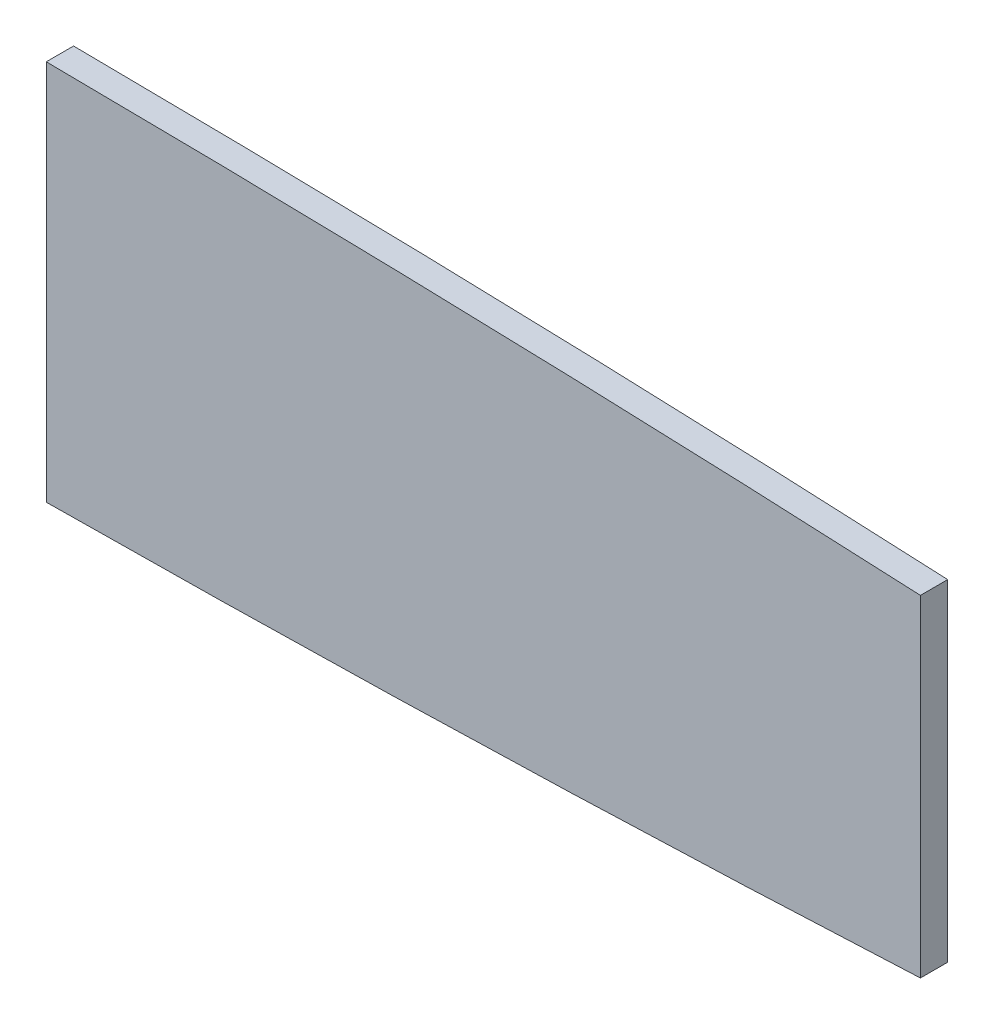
ISO-10303-21;
HEADER;
FILE_DESCRIPTION(('STEP AP214'),'2;1');
FILE_NAME('part.step','',(''),(''),'','','');
FILE_SCHEMA(('AUTOMOTIVE_DESIGN { 1 0 10303 214 1 1 1 1 }'));
ENDSEC;
DATA;
#1=APPLICATION_CONTEXT('core data for automotive mechanical design processes');
#2=APPLICATION_PROTOCOL_DEFINITION('international standard','automotive_design',2000,#1);
#3=PRODUCT_CONTEXT('',#1,'mechanical');
#4=PRODUCT('Part','Part','',(#3));
#5=PRODUCT_RELATED_PRODUCT_CATEGORY('part','',(#4));
#6=PRODUCT_DEFINITION_FORMATION('','',#4);
#7=PRODUCT_DEFINITION_CONTEXT('part definition',#1,'design');
#8=PRODUCT_DEFINITION('design','',#6,#7);
#9=PRODUCT_DEFINITION_SHAPE('','',#8);
#10=(LENGTH_UNIT() NAMED_UNIT(*) SI_UNIT(.MILLI.,.METRE.));
#11=(NAMED_UNIT(*) PLANE_ANGLE_UNIT() SI_UNIT($,.RADIAN.));
#12=(NAMED_UNIT(*) SI_UNIT($,.STERADIAN.) SOLID_ANGLE_UNIT());
#13=UNCERTAINTY_MEASURE_WITH_UNIT(LENGTH_MEASURE(1.E-05),#10,'distance_accuracy_value','');
#14=(GEOMETRIC_REPRESENTATION_CONTEXT(3) GLOBAL_UNCERTAINTY_ASSIGNED_CONTEXT((#13)) GLOBAL_UNIT_ASSIGNED_CONTEXT((#10,
#11,#12)) REPRESENTATION_CONTEXT('',''));
#15=CARTESIAN_POINT('',(0.,0.,0.));
#16=DIRECTION('',(0.,0.,1.));
#17=DIRECTION('',(1.,0.,0.));
#18=AXIS2_PLACEMENT_3D('',#15,#16,#17);
#19=CARTESIAN_POINT('',(-159.996470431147,69.8209004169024,10.));
#20=DIRECTION('',(1.,0.,0.));
#21=DIRECTION('',(0.,1.,0.));
#22=AXIS2_PLACEMENT_3D('',#19,#20,#21);
#23=PLANE('',#22);
#24=DIRECTION('',(0.,-1.,0.));
#25=VECTOR('',#24,1.);
#26=CARTESIAN_POINT('',(-159.996470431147,69.8209004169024,0.));
#27=LINE('',#26,#25);
#28=CARTESIAN_POINT('',(-159.996470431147,69.8209004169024,0.));
#29=VERTEX_POINT('',#28);
#30=CARTESIAN_POINT('',(-159.996470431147,-69.8209004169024,0.));
#31=VERTEX_POINT('',#30);
#32=EDGE_CURVE('E85',#29,#31,#27,.T.);
#33=ORIENTED_EDGE('',*,*,#32,.T.);
#34=DIRECTION('',(0.,0.,-1.));
#35=VECTOR('',#34,1.);
#36=CARTESIAN_POINT('',(-159.996470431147,-69.8209004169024,10.));
#37=LINE('',#36,#35);
#38=CARTESIAN_POINT('',(-159.996470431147,-69.8209004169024,10.));
#39=VERTEX_POINT('',#38);
#40=EDGE_CURVE('E39',#39,#31,#37,.T.);
#41=ORIENTED_EDGE('',*,*,#40,.F.);
#42=DIRECTION('',(0.,-1.,0.));
#43=VECTOR('',#42,1.);
#44=CARTESIAN_POINT('',(-159.996470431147,69.8209004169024,10.));
#45=LINE('',#44,#43);
#46=CARTESIAN_POINT('',(-159.996470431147,69.8209004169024,10.));
#47=VERTEX_POINT('',#46);
#48=EDGE_CURVE('E77',#47,#39,#45,.T.);
#49=ORIENTED_EDGE('',*,*,#48,.F.);
#50=DIRECTION('',(0.,0.,-1.));
#51=VECTOR('',#50,1.);
#52=CARTESIAN_POINT('',(-159.996470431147,69.8209004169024,10.));
#53=LINE('',#52,#51);
#54=EDGE_CURVE('E11',#47,#29,#53,.T.);
#55=ORIENTED_EDGE('',*,*,#54,.T.);
#56=EDGE_LOOP('',(#33,#41,#49,#55));
#57=FACE_BOUND('',#56,.T.);
#58=ADVANCED_FACE('F31',(#57),#23,.F.);
#59=CARTESIAN_POINT('',(-221.019012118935,7649.47700427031,10.));
#60=DIRECTION('',(0.,0.,-1.));
#61=DIRECTION('',(-1.,0.,0.));
#62=AXIS2_PLACEMENT_3D('',#59,#60,#61);
#63=CYLINDRICAL_SURFACE('',#62,7719.53909841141);
#64=CARTESIAN_POINT('',(-221.019012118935,7649.47700427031,0.));
#65=DIRECTION('',(0.,0.,1.));
#66=DIRECTION('',(1.,0.,0.));
#67=AXIS2_PLACEMENT_3D('',#64,#65,#66);
#68=CIRCLE('',#67,7719.53909841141);
#69=CARTESIAN_POINT('',(159.996470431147,-60.6534157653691,0.));
#70=VERTEX_POINT('',#69);
#71=EDGE_CURVE('E64',#31,#70,#68,.T.);
#72=ORIENTED_EDGE('',*,*,#71,.T.);
#73=DIRECTION('',(0.,0.,-1.));
#74=VECTOR('',#73,1.);
#75=CARTESIAN_POINT('',(159.996470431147,-60.6534157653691,10.));
#76=LINE('',#75,#74);
#77=CARTESIAN_POINT('',(159.996470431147,-60.6534157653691,10.));
#78=VERTEX_POINT('',#77);
#79=EDGE_CURVE('E86',#78,#70,#76,.T.);
#80=ORIENTED_EDGE('',*,*,#79,.F.);
#81=CARTESIAN_POINT('',(-221.019012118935,7649.47700427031,10.));
#82=DIRECTION('',(0.,0.,1.));
#83=DIRECTION('',(1.,0.,0.));
#84=AXIS2_PLACEMENT_3D('',#81,#82,#83);
#85=CIRCLE('',#84,7719.53909841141);
#86=EDGE_CURVE('E81',#39,#78,#85,.T.);
#87=ORIENTED_EDGE('',*,*,#86,.F.);
#88=ORIENTED_EDGE('',*,*,#40,.T.);
#89=EDGE_LOOP('',(#72,#80,#87,#88));
#90=FACE_BOUND('',#89,.T.);
#91=ADVANCED_FACE('F87',(#90),#63,.T.);
#92=CARTESIAN_POINT('',(159.996470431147,-60.6534157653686,10.));
#93=DIRECTION('',(-1.,0.,0.));
#94=DIRECTION('',(0.,-1.,0.));
#95=AXIS2_PLACEMENT_3D('',#92,#93,#94);
#96=PLANE('',#95);
#97=DIRECTION('',(0.,1.,0.));
#98=VECTOR('',#97,1.);
#99=CARTESIAN_POINT('',(159.996470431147,-60.6534157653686,0.));
#100=LINE('',#99,#98);
#101=CARTESIAN_POINT('',(159.996470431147,60.6534157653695,0.));
#102=VERTEX_POINT('',#101);
#103=EDGE_CURVE('E71',#70,#102,#100,.T.);
#104=ORIENTED_EDGE('',*,*,#103,.T.);
#105=DIRECTION('',(0.,0.,-1.));
#106=VECTOR('',#105,1.);
#107=CARTESIAN_POINT('',(159.996470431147,60.6534157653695,10.));
#108=LINE('',#107,#106);
#109=CARTESIAN_POINT('',(159.996470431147,60.6534157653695,10.));
#110=VERTEX_POINT('',#109);
#111=EDGE_CURVE('E91',#110,#102,#108,.T.);
#112=ORIENTED_EDGE('',*,*,#111,.F.);
#113=DIRECTION('',(0.,1.,0.));
#114=VECTOR('',#113,1.);
#115=CARTESIAN_POINT('',(159.996470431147,-60.6534157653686,10.));
#116=LINE('',#115,#114);
#117=EDGE_CURVE('E89',#78,#110,#116,.T.);
#118=ORIENTED_EDGE('',*,*,#117,.F.);
#119=ORIENTED_EDGE('',*,*,#79,.T.);
#120=EDGE_LOOP('',(#104,#112,#118,#119));
#121=FACE_BOUND('',#120,.T.);
#122=ADVANCED_FACE('F101',(#121),#96,.F.);
#123=CARTESIAN_POINT('',(-221.019012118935,-7649.47700427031,10.));
#124=DIRECTION('',(0.,0.,-1.));
#125=DIRECTION('',(-1.,0.,0.));
#126=AXIS2_PLACEMENT_3D('',#123,#124,#125);
#127=CYLINDRICAL_SURFACE('',#126,7719.53909841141);
#128=CARTESIAN_POINT('',(-221.019012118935,-7649.47700427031,0.));
#129=DIRECTION('',(0.,0.,1.));
#130=DIRECTION('',(1.,0.,0.));
#131=AXIS2_PLACEMENT_3D('',#128,#129,#130);
#132=CIRCLE('',#131,7719.53909841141);
#133=EDGE_CURVE('E98',#102,#29,#132,.T.);
#134=ORIENTED_EDGE('',*,*,#133,.T.);
#135=ORIENTED_EDGE('',*,*,#54,.F.);
#136=CARTESIAN_POINT('',(-221.019012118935,-7649.47700427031,10.));
#137=DIRECTION('',(0.,0.,1.));
#138=DIRECTION('',(1.,0.,0.));
#139=AXIS2_PLACEMENT_3D('',#136,#137,#138);
#140=CIRCLE('',#139,7719.53909841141);
#141=EDGE_CURVE('E47',#110,#47,#140,.T.);
#142=ORIENTED_EDGE('',*,*,#141,.F.);
#143=ORIENTED_EDGE('',*,*,#111,.T.);
#144=EDGE_LOOP('',(#134,#135,#142,#143));
#145=FACE_BOUND('',#144,.T.);
#146=ADVANCED_FACE('F105',(#145),#127,.T.);
#147=CARTESIAN_POINT('',(-221.019012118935,-7649.47700427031,10.));
#148=DIRECTION('',(0.,0.,1.));
#149=DIRECTION('',(1.,0.,0.));
#150=AXIS2_PLACEMENT_3D('',#147,#148,#149);
#151=PLANE('',#150);
#152=ORIENTED_EDGE('',*,*,#141,.T.);
#153=ORIENTED_EDGE('',*,*,#48,.T.);
#154=ORIENTED_EDGE('',*,*,#86,.T.);
#155=ORIENTED_EDGE('',*,*,#117,.T.);
#156=EDGE_LOOP('',(#152,#153,#154,#155));
#157=FACE_BOUND('',#156,.T.);
#158=ADVANCED_FACE('F79',(#157),#151,.T.);
#159=CARTESIAN_POINT('',(-221.019012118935,-7649.47700427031,0.));
#160=DIRECTION('',(0.,0.,1.));
#161=DIRECTION('',(1.,0.,0.));
#162=AXIS2_PLACEMENT_3D('',#159,#160,#161);
#163=PLANE('',#162);
#164=ORIENTED_EDGE('',*,*,#32,.F.);
#165=ORIENTED_EDGE('',*,*,#133,.F.);
#166=ORIENTED_EDGE('',*,*,#103,.F.);
#167=ORIENTED_EDGE('',*,*,#71,.F.);
#168=EDGE_LOOP('',(#164,#165,#166,#167));
#169=FACE_BOUND('',#168,.T.);
#170=ADVANCED_FACE('F104',(#169),#163,.F.);
#171=CLOSED_SHELL('',(#58,#91,#122,#146,#158,#170));
#172=MANIFOLD_SOLID_BREP('B2',#171);
#173=ADVANCED_BREP_SHAPE_REPRESENTATION('',(#18,#172),#14);
#174=SHAPE_DEFINITION_REPRESENTATION(#9,#173);
ENDSEC;
END-ISO-10303-21;
